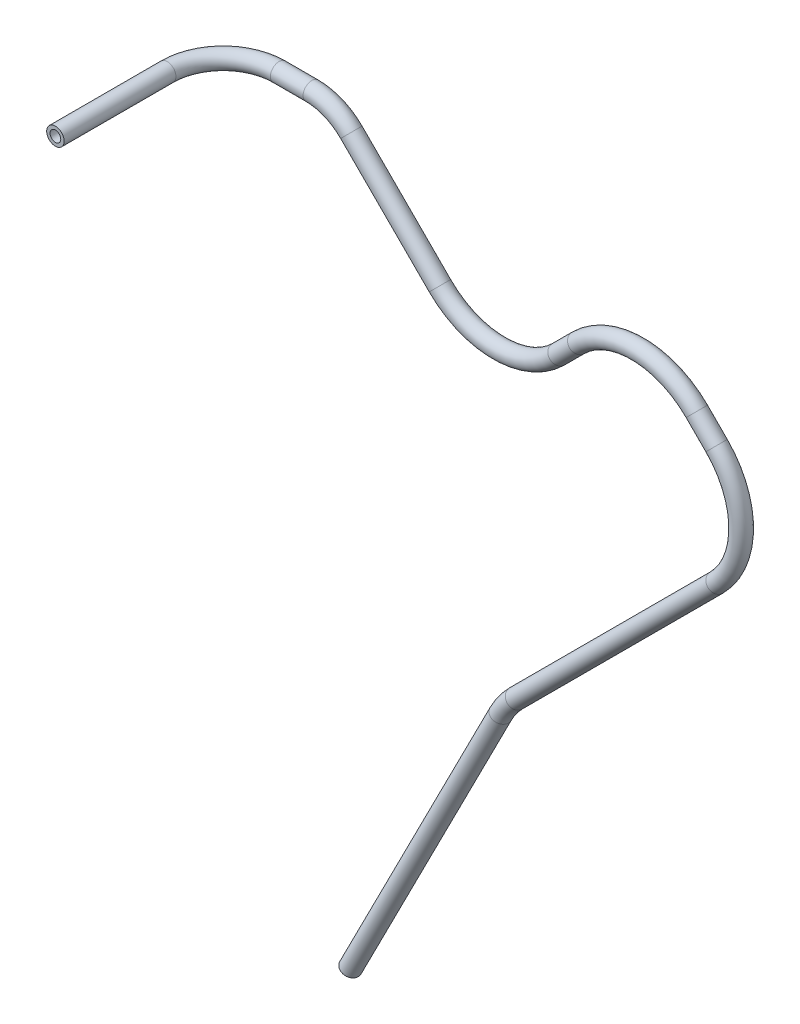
from build123d import *

# Parameters (mm, degrees)
SKETCH1_R   = 7.9375
SKETCH1_R_2 = 4.8641


with BuildPart() as part:
    # Sweep1: sweep along a curve in space
    with BuildLine() as sweep1_path:
        Line((0, 0, 0), (0, 0, -101.6))
        ThreePointArc((50.8, 0, -152.4), (14.878975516, 0, -137.521024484), (0, 0, -101.6))
        Line((50.8, 0, -152.4), (80.557951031, 0, -152.4))
        ThreePointArc((116.478975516, -14.878975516, -152.4), (99.998269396, -3.866919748, -152.4), (80.557951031, 0, -152.4))
        Line((116.478975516, -14.878975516, -152.4), (196.965593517, -95.365593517, -152.4))
        ThreePointArc((304.72866697, -95.365593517, -152.4), (250.847130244, -117.684056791, -152.4), (196.965593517, -95.365593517, -152.4))
        Line((304.72866697, -95.365593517, -152.4), (322.574619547, -77.51964094, -152.4))
        ThreePointArc((430.337693, -77.51964094, -152.4), (376.456156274, -55.201177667, -152.4), (322.574619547, -77.51964094, -152.4))
        Line((430.337693, -77.51964094, -152.4), (448.298205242, -95.480153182, -152.4))
        ThreePointArc((448.298205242, -203.243226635, -152.4), (470.616668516, -149.361689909, -152.4), (448.298205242, -95.480153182, -152.4))
        Line((448.298205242, -203.243226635, -152.4), (266.096877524, -385.444554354, -152.4))
        ThreePointArc((266.096877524, -385.444554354, -152.4), (258.329113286, -394.539891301, -152.4), (252.080309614, -404.738703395, -152.4))
        Line((252.080309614, -404.738703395, -152.4), (115.666291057, -672.531500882, -152.4))
    # Sketch1 → Sweep1 (sweep)
    with BuildSketch(Plane.XY):
        Circle(SKETCH1_R)
        Circle(SKETCH1_R_2, mode=Mode.SUBTRACT)
    sweep(path=sweep1_path.line)


solid = part.part
